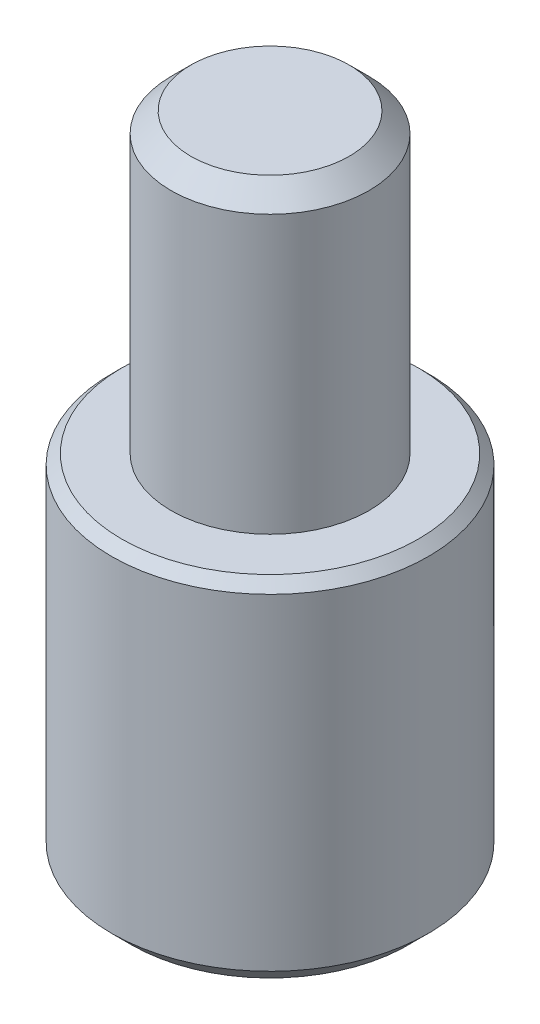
from build123d import *

# Parameters (mm, degrees)
SKETCH1_R      = 4
EXTRUDE1_DEPTH = 9
SKETCH2_R      = 2.5
EXTRUDE2_DEPTH = 7.5
CHAMFER1_SIZE  = 0.254
EXTRUDE3_DEPTH = 3.3
CHAMFER2_SIZE  = 0.5
CHAMFER3_SIZE  = 0.5


with BuildPart() as part:
    # Sketch1 → Extrude1 (new body)
    with BuildSketch(Plane(origin=(0, 0, 0), x_dir=(1, 0, 0), z_dir=(0, 1, 0))):
        with Locations(Location((0, 0, 0), (0, 0, 270))):
            Circle(SKETCH1_R)
    extrude(amount=EXTRUDE1_DEPTH)

    # Sketch2 → Extrude2 (add)
    with BuildSketch(Plane(origin=(0, 9, 0), x_dir=(1, 0, 0), z_dir=(0, 1, 0))):
        with Locations(Location((0, 0, 0), (0, 0, 270))):
            Circle(SKETCH2_R)
    extrude(amount=EXTRUDE2_DEPTH)

    # Chamfer1
    chamfer1_edges = [part.edges().sort_by_distance(p)[0] for p in [
        (0, 9, -4),
    ]]
    chamfer(chamfer1_edges, length=CHAMFER1_SIZE)

    # Sketch3 → Extrude3 (cut)
    with BuildSketch(Plane.XZ):
        Polygon((0.866025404, 1.5), (-0.866025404, 1.5), (-1.732050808, 0), (-0.866025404, -1.5), (0.866025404, -1.5), (1.732050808, 0), align=None)
    extrude(amount=-EXTRUDE3_DEPTH, mode=Mode.SUBTRACT)

    # Chamfer2
    chamfer2_edges = [part.edges().sort_by_distance(p)[0] for p in [
        (0, 0, -4),
    ]]
    chamfer(chamfer2_edges, length=CHAMFER2_SIZE)

    # Chamfer3
    chamfer3_edges = [part.edges().sort_by_distance(p)[0] for p in [
        (0, 16.5, -2.5),
    ]]
    chamfer(chamfer3_edges, length=CHAMFER3_SIZE)


solid = part.part
